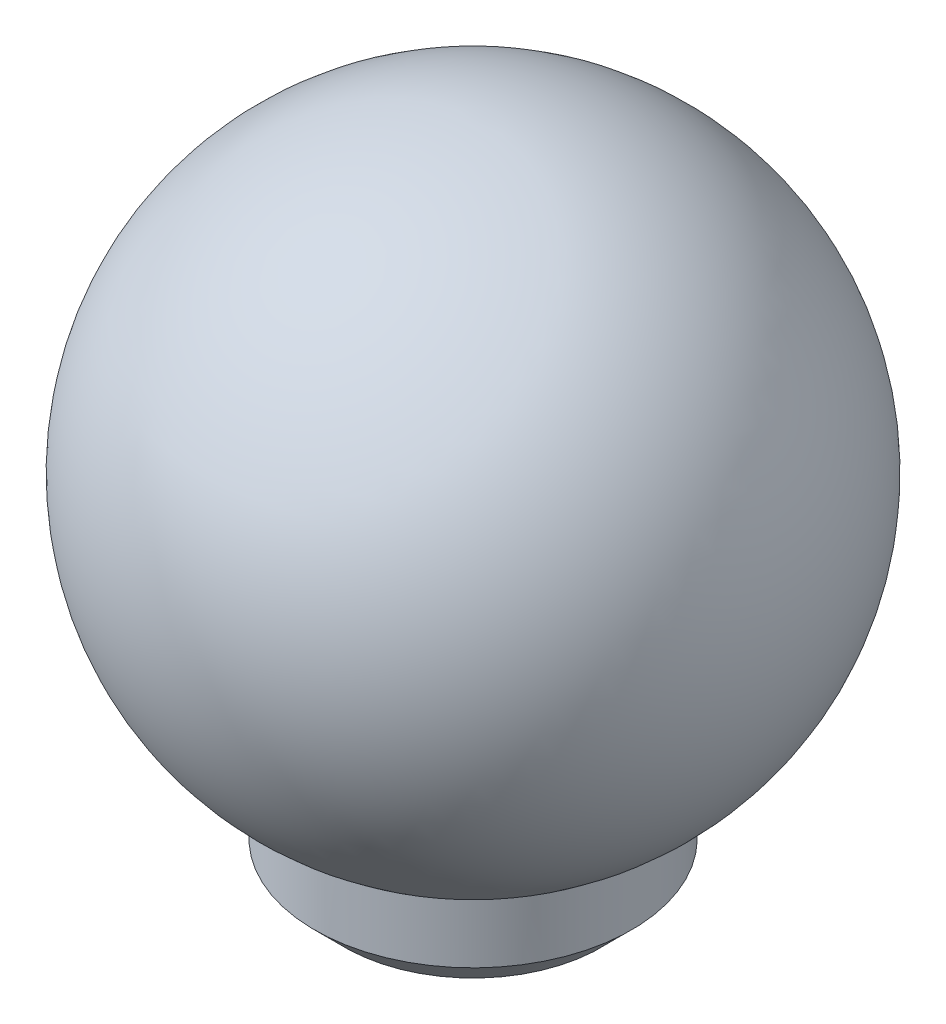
ISO-10303-21;
HEADER;
FILE_DESCRIPTION(('STEP AP214'),'2;1');
FILE_NAME('part.step','',(''),(''),'','','');
FILE_SCHEMA(('AUTOMOTIVE_DESIGN { 1 0 10303 214 1 1 1 1 }'));
ENDSEC;
DATA;
#1=APPLICATION_CONTEXT('core data for automotive mechanical design processes');
#2=APPLICATION_PROTOCOL_DEFINITION('international standard','automotive_design',2000,#1);
#3=PRODUCT_CONTEXT('',#1,'mechanical');
#4=PRODUCT('Part','Part','',(#3));
#5=PRODUCT_RELATED_PRODUCT_CATEGORY('part','',(#4));
#6=PRODUCT_DEFINITION_FORMATION('','',#4);
#7=PRODUCT_DEFINITION_CONTEXT('part definition',#1,'design');
#8=PRODUCT_DEFINITION('design','',#6,#7);
#9=PRODUCT_DEFINITION_SHAPE('','',#8);
#10=(LENGTH_UNIT() NAMED_UNIT(*) SI_UNIT(.MILLI.,.METRE.));
#11=(NAMED_UNIT(*) PLANE_ANGLE_UNIT() SI_UNIT($,.RADIAN.));
#12=(NAMED_UNIT(*) SI_UNIT($,.STERADIAN.) SOLID_ANGLE_UNIT());
#13=UNCERTAINTY_MEASURE_WITH_UNIT(LENGTH_MEASURE(1.E-05),#10,'distance_accuracy_value','');
#14=(GEOMETRIC_REPRESENTATION_CONTEXT(3) GLOBAL_UNCERTAINTY_ASSIGNED_CONTEXT((#13)) GLOBAL_UNIT_ASSIGNED_CONTEXT((#10,
#11,#12)) REPRESENTATION_CONTEXT('',''));
#15=CARTESIAN_POINT('',(0.,0.,0.));
#16=DIRECTION('',(0.,0.,1.));
#17=DIRECTION('',(1.,0.,0.));
#18=AXIS2_PLACEMENT_3D('',#15,#16,#17);
#19=CARTESIAN_POINT('',(6.66750000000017,-14.5910017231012,0.));
#20=DIRECTION('',(0.,1.,0.));
#21=DIRECTION('',(-1.,0.,0.));
#22=AXIS2_PLACEMENT_3D('',#19,#20,#21);
#23=PLANE('',#22);
#24=CARTESIAN_POINT('',(1.73660199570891E-13,-14.5910017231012,0.));
#25=DIRECTION('',(0.,1.,0.));
#26=DIRECTION('',(-1.,0.,0.));
#27=AXIS2_PLACEMENT_3D('',#24,#25,#26);
#28=CIRCLE('',#27,5.39750000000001);
#29=CARTESIAN_POINT('',(-5.39749999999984,-14.5910017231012,0.));
#30=VERTEX_POINT('',#29);
#31=EDGE_CURVE('E10',#30,#30,#28,.F.);
#32=ORIENTED_EDGE('',*,*,#31,.T.);
#33=EDGE_LOOP('',(#32));
#34=FACE_BOUND('',#33,.T.);
#35=ADVANCED_FACE('F28',(#34),#23,.F.);
#36=CARTESIAN_POINT('',(1.73472347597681E-13,0.,0.));
#37=DIRECTION('',(0.,1.,0.));
#38=DIRECTION('',(1.,0.,0.));
#39=AXIS2_PLACEMENT_3D('',#36,#37,#38);
#40=SPHERICAL_SURFACE('',#39,12.7);
#41=CARTESIAN_POINT('',(1.73284495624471E-13,-10.8089982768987,0.));
#42=DIRECTION('',(0.,1.,0.));
#43=DIRECTION('',(-1.,0.,0.));
#44=AXIS2_PLACEMENT_3D('',#41,#42,#43);
#45=CIRCLE('',#44,6.6675);
#46=CARTESIAN_POINT('',(-6.66749999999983,-10.8089982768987,0.));
#47=VERTEX_POINT('',#46);
#48=EDGE_CURVE('E38',#47,#47,#45,.T.);
#49=ORIENTED_EDGE('',*,*,#48,.T.);
#50=EDGE_LOOP('',(#49));
#51=FACE_BOUND('',#50,.T.);
#52=ADVANCED_FACE('F45',(#51),#40,.T.);
#53=CARTESIAN_POINT('',(1.73472347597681E-13,-12.7,0.));
#54=DIRECTION('',(0.,1.,0.));
#55=DIRECTION('',(-1.,0.,0.));
#56=AXIS2_PLACEMENT_3D('',#53,#54,#55);
#57=CYLINDRICAL_SURFACE('',#56,6.6675);
#58=CARTESIAN_POINT('',(1.73534037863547E-13,-13.3210017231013,0.));
#59=DIRECTION('',(0.,1.,0.));
#60=DIRECTION('',(-1.,0.,0.));
#61=AXIS2_PLACEMENT_3D('',#58,#59,#60);
#62=CIRCLE('',#61,6.6675);
#63=CARTESIAN_POINT('',(-6.66749999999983,-13.3210017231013,0.));
#64=VERTEX_POINT('',#63);
#65=EDGE_CURVE('E34',#64,#64,#62,.T.);
#66=ORIENTED_EDGE('',*,*,#65,.T.);
#67=EDGE_LOOP('',(#66));
#68=FACE_BOUND('',#67,.T.);
#69=ORIENTED_EDGE('',*,*,#48,.F.);
#70=EDGE_LOOP('',(#69));
#71=FACE_BOUND('',#70,.T.);
#72=ADVANCED_FACE('F47',(#68,#71),#57,.T.);
#73=CARTESIAN_POINT('',(1.73534037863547E-13,-13.3210017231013,0.));
#74=DIRECTION('',(0.,1.,0.));
#75=DIRECTION('',(-1.,0.,0.));
#76=AXIS2_PLACEMENT_3D('',#73,#74,#75);
#77=CONICAL_SURFACE('',#76,6.6675,0.785398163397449);
#78=ORIENTED_EDGE('',*,*,#31,.F.);
#79=EDGE_LOOP('',(#78));
#80=FACE_BOUND('',#79,.T.);
#81=ORIENTED_EDGE('',*,*,#65,.F.);
#82=EDGE_LOOP('',(#81));
#83=FACE_BOUND('',#82,.T.);
#84=ADVANCED_FACE('F49',(#80,#83),#77,.T.);
#85=CLOSED_SHELL('',(#35,#52,#72,#84));
#86=MANIFOLD_SOLID_BREP('B2',#85);
#87=ADVANCED_BREP_SHAPE_REPRESENTATION('',(#18,#86),#14);
#88=SHAPE_DEFINITION_REPRESENTATION(#9,#87);
ENDSEC;
END-ISO-10303-21;
